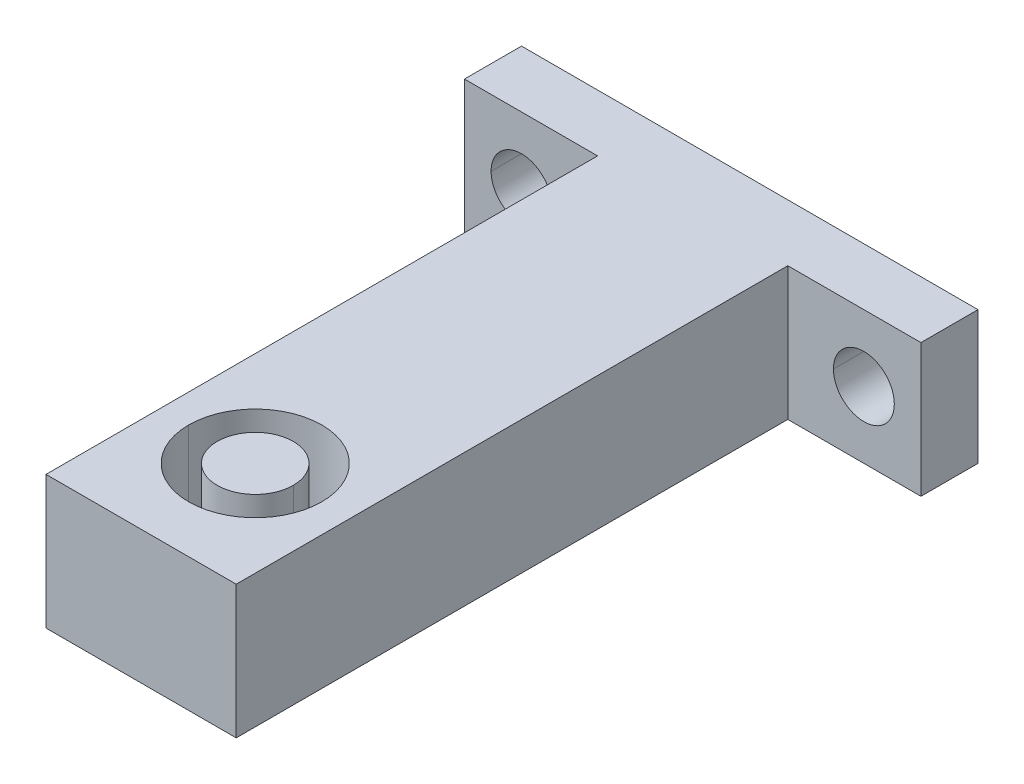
ISO-10303-21;
HEADER;
FILE_DESCRIPTION(('STEP AP214'),'2;1');
FILE_NAME('part.step','',(''),(''),'','','');
FILE_SCHEMA(('AUTOMOTIVE_DESIGN { 1 0 10303 214 1 1 1 1 }'));
ENDSEC;
DATA;
#1=APPLICATION_CONTEXT('core data for automotive mechanical design processes');
#2=APPLICATION_PROTOCOL_DEFINITION('international standard','automotive_design',2000,#1);
#3=PRODUCT_CONTEXT('',#1,'mechanical');
#4=PRODUCT('Part','Part','',(#3));
#5=PRODUCT_RELATED_PRODUCT_CATEGORY('part','',(#4));
#6=PRODUCT_DEFINITION_FORMATION('','',#4);
#7=PRODUCT_DEFINITION_CONTEXT('part definition',#1,'design');
#8=PRODUCT_DEFINITION('design','',#6,#7);
#9=PRODUCT_DEFINITION_SHAPE('','',#8);
#10=(LENGTH_UNIT() NAMED_UNIT(*) SI_UNIT(.MILLI.,.METRE.));
#11=(NAMED_UNIT(*) PLANE_ANGLE_UNIT() SI_UNIT($,.RADIAN.));
#12=(NAMED_UNIT(*) SI_UNIT($,.STERADIAN.) SOLID_ANGLE_UNIT());
#13=UNCERTAINTY_MEASURE_WITH_UNIT(LENGTH_MEASURE(1.E-05),#10,'distance_accuracy_value','');
#14=(GEOMETRIC_REPRESENTATION_CONTEXT(3) GLOBAL_UNCERTAINTY_ASSIGNED_CONTEXT((#13)) GLOBAL_UNIT_ASSIGNED_CONTEXT((#10,
#11,#12)) REPRESENTATION_CONTEXT('',''));
#15=CARTESIAN_POINT('',(0.,0.,0.));
#16=DIRECTION('',(0.,0.,1.));
#17=DIRECTION('',(1.,0.,0.));
#18=AXIS2_PLACEMENT_3D('',#15,#16,#17);
#19=CARTESIAN_POINT('',(15.875,11.1125,-63.5));
#20=DIRECTION('',(0.,1.,0.));
#21=DIRECTION('',(0.,0.,1.));
#22=AXIS2_PLACEMENT_3D('',#19,#20,#21);
#23=PLANE('',#22);
#24=CARTESIAN_POINT('',(0.,11.1125,31.75));
#25=DIRECTION('',(0.,-1.,0.));
#26=DIRECTION('',(0.,0.,-1.));
#27=AXIS2_PLACEMENT_3D('',#24,#25,#26);
#28=CIRCLE('',#27,6.35);
#29=CARTESIAN_POINT('',(6.35,11.1125,31.75));
#30=VERTEX_POINT('',#29);
#31=CARTESIAN_POINT('',(-6.35,11.1125,31.75));
#32=VERTEX_POINT('',#31);
#33=EDGE_CURVE('P0_E47',#30,#32,#28,.T.);
#34=ORIENTED_EDGE('',*,*,#33,.F.);
#35=CARTESIAN_POINT('',(0.,11.1125,31.75));
#36=DIRECTION('',(0.,-1.,0.));
#37=DIRECTION('',(0.,0.,-1.));
#38=AXIS2_PLACEMENT_3D('',#35,#36,#37);
#39=CIRCLE('',#38,6.35);
#40=EDGE_CURVE('P0_E19',#32,#30,#39,.T.);
#41=ORIENTED_EDGE('',*,*,#40,.F.);
#42=EDGE_LOOP('',(#34,#41));
#43=FACE_BOUND('',#42,.T.);
#44=ADVANCED_FACE('P0_F16',(#43),#23,.T.);
#45=CARTESIAN_POINT('',(0.,0.,31.75));
#46=DIRECTION('',(0.,-1.,0.));
#47=DIRECTION('',(0.,0.,-1.));
#48=AXIS2_PLACEMENT_3D('',#45,#46,#47);
#49=CYLINDRICAL_SURFACE('',#48,6.35);
#50=DIRECTION('',(0.,-1.,0.));
#51=VECTOR('',#50,1.);
#52=CARTESIAN_POINT('',(-6.35,0.,31.75));
#53=LINE('',#52,#51);
#54=CARTESIAN_POINT('',(-6.35,-11.1125,31.75));
#55=VERTEX_POINT('',#54);
#56=EDGE_CURVE('P0_E25',#32,#55,#53,.T.);
#57=ORIENTED_EDGE('',*,*,#56,.F.);
#58=ORIENTED_EDGE('',*,*,#40,.T.);
#59=DIRECTION('',(0.,-1.,0.));
#60=VECTOR('',#59,1.);
#61=CARTESIAN_POINT('',(6.35,0.,31.75));
#62=LINE('',#61,#60);
#63=CARTESIAN_POINT('',(6.35,-11.1125,31.75));
#64=VERTEX_POINT('',#63);
#65=EDGE_CURVE('P0_E41',#64,#30,#62,.F.);
#66=ORIENTED_EDGE('',*,*,#65,.F.);
#67=CARTESIAN_POINT('',(0.,-11.1125,31.75));
#68=DIRECTION('',(0.,-1.,0.));
#69=DIRECTION('',(0.,0.,-1.));
#70=AXIS2_PLACEMENT_3D('',#67,#68,#69);
#71=CIRCLE('',#70,6.35);
#72=EDGE_CURVE('P0_E34',#55,#64,#71,.T.);
#73=ORIENTED_EDGE('',*,*,#72,.F.);
#74=EDGE_LOOP('',(#57,#58,#66,#73));
#75=FACE_BOUND('',#74,.T.);
#76=ADVANCED_FACE('P0_F43',(#75),#49,.T.);
#77=CARTESIAN_POINT('',(15.875,-11.1125,50.8));
#78=DIRECTION('',(0.,-1.,0.));
#79=DIRECTION('',(0.,0.,-1.));
#80=AXIS2_PLACEMENT_3D('',#77,#78,#79);
#81=PLANE('',#80);
#82=ORIENTED_EDGE('',*,*,#72,.T.);
#83=CARTESIAN_POINT('',(0.,-11.1125,31.75));
#84=DIRECTION('',(0.,-1.,0.));
#85=DIRECTION('',(0.,0.,-1.));
#86=AXIS2_PLACEMENT_3D('',#83,#84,#85);
#87=CIRCLE('',#86,6.35);
#88=EDGE_CURVE('P0_E11',#55,#64,#87,.F.);
#89=ORIENTED_EDGE('',*,*,#88,.F.);
#90=EDGE_LOOP('',(#82,#89));
#91=FACE_BOUND('',#90,.T.);
#92=ADVANCED_FACE('P0_F54',(#91),#81,.T.);
#93=CARTESIAN_POINT('',(0.,0.,31.75));
#94=DIRECTION('',(0.,-1.,0.));
#95=DIRECTION('',(0.,0.,-1.));
#96=AXIS2_PLACEMENT_3D('',#93,#94,#95);
#97=CYLINDRICAL_SURFACE('',#96,6.35);
#98=ORIENTED_EDGE('',*,*,#56,.T.);
#99=ORIENTED_EDGE('',*,*,#88,.T.);
#100=ORIENTED_EDGE('',*,*,#65,.T.);
#101=ORIENTED_EDGE('',*,*,#33,.T.);
#102=EDGE_LOOP('',(#98,#99,#100,#101));
#103=FACE_BOUND('',#102,.T.);
#104=ADVANCED_FACE('P0_F50',(#103),#97,.T.);
#105=CLOSED_SHELL('',(#44,#76,#92,#104));
#106=MANIFOLD_SOLID_BREP('P0_B1',#105);
#107=CARTESIAN_POINT('',(28.575,0.,-44.45));
#108=DIRECTION('',(0.,0.,1.));
#109=DIRECTION('',(1.,0.,0.));
#110=AXIS2_PLACEMENT_3D('',#107,#108,#109);
#111=CYLINDRICAL_SURFACE('',#110,5.08);
#112=CARTESIAN_POINT('',(28.575,0.,-50.8));
#113=DIRECTION('',(0.,0.,1.));
#114=DIRECTION('',(1.,0.,0.));
#115=AXIS2_PLACEMENT_3D('',#112,#113,#114);
#116=CIRCLE('',#115,5.08);
#117=CARTESIAN_POINT('',(33.655,0.,-50.8));
#118=VERTEX_POINT('',#117);
#119=CARTESIAN_POINT('',(23.495,0.,-50.8));
#120=VERTEX_POINT('',#119);
#121=EDGE_CURVE('P1_E160',#118,#120,#116,.F.);
#122=ORIENTED_EDGE('',*,*,#121,.T.);
#123=DIRECTION('',(0.,0.,1.));
#124=VECTOR('',#123,1.);
#125=CARTESIAN_POINT('',(23.495,0.,-44.45));
#126=LINE('',#125,#124);
#127=CARTESIAN_POINT('',(23.495,0.,-41.275));
#128=VERTEX_POINT('',#127);
#129=EDGE_CURVE('P1_E144',#120,#128,#126,.T.);
#130=ORIENTED_EDGE('',*,*,#129,.T.);
#131=CARTESIAN_POINT('',(28.575,0.,-41.275));
#132=DIRECTION('',(0.,0.,1.));
#133=DIRECTION('',(1.,0.,0.));
#134=AXIS2_PLACEMENT_3D('',#131,#132,#133);
#135=CIRCLE('',#134,5.08);
#136=CARTESIAN_POINT('',(33.655,0.,-41.275));
#137=VERTEX_POINT('',#136);
#138=EDGE_CURVE('P1_E164',#137,#128,#135,.F.);
#139=ORIENTED_EDGE('',*,*,#138,.F.);
#140=DIRECTION('',(0.,0.,1.));
#141=VECTOR('',#140,1.);
#142=CARTESIAN_POINT('',(33.655,0.,-44.45));
#143=LINE('',#142,#141);
#144=EDGE_CURVE('P1_E141',#137,#118,#143,.F.);
#145=ORIENTED_EDGE('',*,*,#144,.T.);
#146=EDGE_LOOP('',(#122,#130,#139,#145));
#147=FACE_BOUND('',#146,.T.);
#148=ADVANCED_FACE('P1_F16',(#147),#111,.F.);
#149=CARTESIAN_POINT('',(28.575,0.,-44.45));
#150=DIRECTION('',(0.,0.,1.));
#151=DIRECTION('',(1.,0.,0.));
#152=AXIS2_PLACEMENT_3D('',#149,#150,#151);
#153=CYLINDRICAL_SURFACE('',#152,5.08);
#154=CARTESIAN_POINT('',(28.575,0.,-41.275));
#155=DIRECTION('',(0.,0.,1.));
#156=DIRECTION('',(1.,0.,0.));
#157=AXIS2_PLACEMENT_3D('',#154,#155,#156);
#158=CIRCLE('',#157,5.08);
#159=EDGE_CURVE('P1_E168',#128,#137,#158,.F.);
#160=ORIENTED_EDGE('',*,*,#159,.F.);
#161=ORIENTED_EDGE('',*,*,#129,.F.);
#162=CARTESIAN_POINT('',(28.575,0.,-50.8));
#163=DIRECTION('',(0.,0.,1.));
#164=DIRECTION('',(1.,0.,0.));
#165=AXIS2_PLACEMENT_3D('',#162,#163,#164);
#166=CIRCLE('',#165,5.08);
#167=EDGE_CURVE('P1_E157',#120,#118,#166,.F.);
#168=ORIENTED_EDGE('',*,*,#167,.T.);
#169=ORIENTED_EDGE('',*,*,#144,.F.);
#170=EDGE_LOOP('',(#160,#161,#168,#169));
#171=FACE_BOUND('',#170,.T.);
#172=ADVANCED_FACE('P1_F198',(#171),#153,.F.);
#173=CARTESIAN_POINT('',(-28.575,0.,-44.45));
#174=DIRECTION('',(0.,0.,1.));
#175=DIRECTION('',(1.,0.,0.));
#176=AXIS2_PLACEMENT_3D('',#173,#174,#175);
#177=CYLINDRICAL_SURFACE('',#176,5.08);
#178=CARTESIAN_POINT('',(-28.575,0.,-50.8));
#179=DIRECTION('',(0.,0.,1.));
#180=DIRECTION('',(1.,0.,0.));
#181=AXIS2_PLACEMENT_3D('',#178,#179,#180);
#182=CIRCLE('',#181,5.08);
#183=CARTESIAN_POINT('',(-23.495,0.,-50.8));
#184=VERTEX_POINT('',#183);
#185=CARTESIAN_POINT('',(-33.655,0.,-50.8));
#186=VERTEX_POINT('',#185);
#187=EDGE_CURVE('P1_E154',#184,#186,#182,.F.);
#188=ORIENTED_EDGE('',*,*,#187,.T.);
#189=DIRECTION('',(0.,0.,1.));
#190=VECTOR('',#189,1.);
#191=CARTESIAN_POINT('',(-33.655,0.,-44.45));
#192=LINE('',#191,#190);
#193=CARTESIAN_POINT('',(-33.655,0.,-41.275));
#194=VERTEX_POINT('',#193);
#195=EDGE_CURVE('P1_E139',#186,#194,#192,.T.);
#196=ORIENTED_EDGE('',*,*,#195,.T.);
#197=CARTESIAN_POINT('',(-28.575,0.,-41.275));
#198=DIRECTION('',(0.,0.,1.));
#199=DIRECTION('',(1.,0.,0.));
#200=AXIS2_PLACEMENT_3D('',#197,#198,#199);
#201=CIRCLE('',#200,5.08);
#202=CARTESIAN_POINT('',(-23.495,0.,-41.275));
#203=VERTEX_POINT('',#202);
#204=EDGE_CURVE('P1_E172',#203,#194,#201,.F.);
#205=ORIENTED_EDGE('',*,*,#204,.F.);
#206=DIRECTION('',(0.,0.,1.));
#207=VECTOR('',#206,1.);
#208=CARTESIAN_POINT('',(-23.495,0.,-44.45));
#209=LINE('',#208,#207);
#210=EDGE_CURVE('P1_E127',#203,#184,#209,.F.);
#211=ORIENTED_EDGE('',*,*,#210,.T.);
#212=EDGE_LOOP('',(#188,#196,#205,#211));
#213=FACE_BOUND('',#212,.T.);
#214=ADVANCED_FACE('P1_F183',(#213),#177,.F.);
#215=CARTESIAN_POINT('',(-28.575,0.,-44.45));
#216=DIRECTION('',(0.,0.,1.));
#217=DIRECTION('',(1.,0.,0.));
#218=AXIS2_PLACEMENT_3D('',#215,#216,#217);
#219=CYLINDRICAL_SURFACE('',#218,5.08);
#220=CARTESIAN_POINT('',(-28.575,0.,-41.275));
#221=DIRECTION('',(0.,0.,1.));
#222=DIRECTION('',(1.,0.,0.));
#223=AXIS2_PLACEMENT_3D('',#220,#221,#222);
#224=CIRCLE('',#223,5.08);
#225=EDGE_CURVE('P1_E133',#194,#203,#224,.F.);
#226=ORIENTED_EDGE('',*,*,#225,.F.);
#227=ORIENTED_EDGE('',*,*,#195,.F.);
#228=CARTESIAN_POINT('',(-28.575,0.,-50.8));
#229=DIRECTION('',(0.,0.,1.));
#230=DIRECTION('',(1.,0.,0.));
#231=AXIS2_PLACEMENT_3D('',#228,#229,#230);
#232=CIRCLE('',#231,5.08);
#233=EDGE_CURVE('P1_E151',#186,#184,#232,.F.);
#234=ORIENTED_EDGE('',*,*,#233,.T.);
#235=ORIENTED_EDGE('',*,*,#210,.F.);
#236=EDGE_LOOP('',(#226,#227,#234,#235));
#237=FACE_BOUND('',#236,.T.);
#238=ADVANCED_FACE('P1_F185',(#237),#219,.F.);
#239=CARTESIAN_POINT('',(17.4625,11.1125,-46.0375));
#240=DIRECTION('',(0.,-1.,0.));
#241=DIRECTION('',(0.,0.,-1.));
#242=AXIS2_PLACEMENT_3D('',#239,#240,#241);
#243=PLANE('',#242);
#244=DIRECTION('',(0.,0.,1.));
#245=VECTOR('',#244,1.);
#246=CARTESIAN_POINT('',(-38.1,11.1125,-50.8));
#247=LINE('',#246,#245);
#248=CARTESIAN_POINT('',(-38.1,11.1125,-41.275));
#249=VERTEX_POINT('',#248);
#250=CARTESIAN_POINT('',(-38.1,11.1125,-50.8));
#251=VERTEX_POINT('',#250);
#252=EDGE_CURVE('P1_E131',#249,#251,#247,.F.);
#253=ORIENTED_EDGE('',*,*,#252,.F.);
#254=DIRECTION('',(1.,0.,0.));
#255=VECTOR('',#254,1.);
#256=CARTESIAN_POINT('',(-17.4625,11.1125,-41.275));
#257=LINE('',#256,#255);
#258=CARTESIAN_POINT('',(-15.875,11.1125,-41.275));
#259=VERTEX_POINT('',#258);
#260=EDGE_CURVE('P1_E175',#259,#249,#257,.F.);
#261=ORIENTED_EDGE('',*,*,#260,.F.);
#262=DIRECTION('',(0.,0.,1.));
#263=VECTOR('',#262,1.);
#264=CARTESIAN_POINT('',(-15.875,11.1125,50.8));
#265=LINE('',#264,#263);
#266=CARTESIAN_POINT('',(-15.875,11.1125,50.8));
#267=VERTEX_POINT('',#266);
#268=EDGE_CURVE('P1_E269',#267,#259,#265,.F.);
#269=ORIENTED_EDGE('',*,*,#268,.F.);
#270=DIRECTION('',(1.,0.,0.));
#271=VECTOR('',#270,1.);
#272=CARTESIAN_POINT('',(15.875,11.1125,50.8));
#273=LINE('',#272,#271);
#274=CARTESIAN_POINT('',(15.875,11.1125,50.8));
#275=VERTEX_POINT('',#274);
#276=EDGE_CURVE('P1_E264',#275,#267,#273,.F.);
#277=ORIENTED_EDGE('',*,*,#276,.F.);
#278=DIRECTION('',(0.,0.,1.));
#279=VECTOR('',#278,1.);
#280=CARTESIAN_POINT('',(15.875,11.1125,-6.35));
#281=LINE('',#280,#279);
#282=CARTESIAN_POINT('',(15.875,11.1125,-41.275));
#283=VERTEX_POINT('',#282);
#284=EDGE_CURVE('P1_E171',#275,#283,#281,.F.);
#285=ORIENTED_EDGE('',*,*,#284,.T.);
#286=DIRECTION('',(1.,0.,0.));
#287=VECTOR('',#286,1.);
#288=CARTESIAN_POINT('',(17.4625,11.1125,-41.275));
#289=LINE('',#288,#287);
#290=CARTESIAN_POINT('',(38.1,11.1125,-41.275));
#291=VERTEX_POINT('',#290);
#292=EDGE_CURVE('P1_E167',#291,#283,#289,.F.);
#293=ORIENTED_EDGE('',*,*,#292,.F.);
#294=DIRECTION('',(0.,0.,-1.));
#295=VECTOR('',#294,1.);
#296=CARTESIAN_POINT('',(38.1,11.1125,-50.8));
#297=LINE('',#296,#295);
#298=CARTESIAN_POINT('',(38.1,11.1125,-50.8));
#299=VERTEX_POINT('',#298);
#300=EDGE_CURVE('P1_E163',#299,#291,#297,.F.);
#301=ORIENTED_EDGE('',*,*,#300,.F.);
#302=DIRECTION('',(1.,0.,0.));
#303=VECTOR('',#302,1.);
#304=CARTESIAN_POINT('',(17.4625,11.1125,-50.8));
#305=LINE('',#304,#303);
#306=EDGE_CURVE('P1_E250',#299,#251,#305,.F.);
#307=ORIENTED_EDGE('',*,*,#306,.T.);
#308=EDGE_LOOP('',(#253,#261,#269,#277,#285,#293,#301,#307));
#309=FACE_BOUND('',#308,.T.);
#310=CARTESIAN_POINT('',(0.,11.1125,31.75));
#311=DIRECTION('',(0.,-1.,0.));
#312=DIRECTION('',(0.,0.,-1.));
#313=AXIS2_PLACEMENT_3D('',#310,#311,#312);
#314=CIRCLE('',#313,11.1125);
#315=CARTESIAN_POINT('',(11.1125,11.1125,31.75));
#316=VERTEX_POINT('',#315);
#317=CARTESIAN_POINT('',(-11.1125,11.1125,31.75));
#318=VERTEX_POINT('',#317);
#319=EDGE_CURVE('P1_E119',#316,#318,#314,.T.);
#320=ORIENTED_EDGE('',*,*,#319,.T.);
#321=CARTESIAN_POINT('',(0.,11.1125,31.75));
#322=DIRECTION('',(0.,-1.,0.));
#323=DIRECTION('',(0.,0.,-1.));
#324=AXIS2_PLACEMENT_3D('',#321,#322,#323);
#325=CIRCLE('',#324,11.1125);
#326=EDGE_CURVE('P1_E19',#318,#316,#325,.T.);
#327=ORIENTED_EDGE('',*,*,#326,.T.);
#328=EDGE_LOOP('',(#320,#327));
#329=FACE_BOUND('',#328,.T.);
#330=ADVANCED_FACE('P1_F126',(#309,#329),#243,.F.);
#331=CARTESIAN_POINT('',(0.,0.,31.75));
#332=DIRECTION('',(0.,-1.,0.));
#333=DIRECTION('',(0.,0.,-1.));
#334=AXIS2_PLACEMENT_3D('',#331,#332,#333);
#335=CYLINDRICAL_SURFACE('',#334,11.1125);
#336=ORIENTED_EDGE('',*,*,#326,.F.);
#337=DIRECTION('',(0.,-1.,0.));
#338=VECTOR('',#337,1.);
#339=CARTESIAN_POINT('',(-11.1125,0.,31.75));
#340=LINE('',#339,#338);
#341=CARTESIAN_POINT('',(-11.1125,-11.1125,31.75));
#342=VERTEX_POINT('',#341);
#343=EDGE_CURVE('P1_E124',#318,#342,#340,.T.);
#344=ORIENTED_EDGE('',*,*,#343,.T.);
#345=CARTESIAN_POINT('',(0.,-11.1125,31.75));
#346=DIRECTION('',(0.,-1.,0.));
#347=DIRECTION('',(0.,0.,-1.));
#348=AXIS2_PLACEMENT_3D('',#345,#346,#347);
#349=CIRCLE('',#348,11.1125);
#350=CARTESIAN_POINT('',(11.1125,-11.1125,31.75));
#351=VERTEX_POINT('',#350);
#352=EDGE_CURVE('P1_E130',#342,#351,#349,.T.);
#353=ORIENTED_EDGE('',*,*,#352,.T.);
#354=DIRECTION('',(0.,-1.,0.));
#355=VECTOR('',#354,1.);
#356=CARTESIAN_POINT('',(11.1125,0.,31.75));
#357=LINE('',#356,#355);
#358=EDGE_CURVE('P1_E122',#351,#316,#357,.F.);
#359=ORIENTED_EDGE('',*,*,#358,.T.);
#360=EDGE_LOOP('',(#336,#344,#353,#359));
#361=FACE_BOUND('',#360,.T.);
#362=ADVANCED_FACE('P1_F129',(#361),#335,.F.);
#363=CARTESIAN_POINT('',(0.,0.,31.75));
#364=DIRECTION('',(0.,-1.,0.));
#365=DIRECTION('',(0.,0.,-1.));
#366=AXIS2_PLACEMENT_3D('',#363,#364,#365);
#367=CYLINDRICAL_SURFACE('',#366,11.1125);
#368=CARTESIAN_POINT('',(0.,-11.1125,31.75));
#369=DIRECTION('',(0.,-1.,0.));
#370=DIRECTION('',(0.,0.,-1.));
#371=AXIS2_PLACEMENT_3D('',#368,#369,#370);
#372=CIRCLE('',#371,11.1125);
#373=EDGE_CURVE('P1_E146',#351,#342,#372,.T.);
#374=ORIENTED_EDGE('',*,*,#373,.T.);
#375=ORIENTED_EDGE('',*,*,#343,.F.);
#376=ORIENTED_EDGE('',*,*,#319,.F.);
#377=ORIENTED_EDGE('',*,*,#358,.F.);
#378=EDGE_LOOP('',(#374,#375,#376,#377));
#379=FACE_BOUND('',#378,.T.);
#380=ADVANCED_FACE('P1_F121',(#379),#367,.F.);
#381=CARTESIAN_POINT('',(-38.1,-11.1125,-50.8));
#382=DIRECTION('',(-1.,0.,0.));
#383=DIRECTION('',(0.,0.,1.));
#384=AXIS2_PLACEMENT_3D('',#381,#382,#383);
#385=PLANE('',#384);
#386=DIRECTION('',(0.,1.,0.));
#387=VECTOR('',#386,1.);
#388=CARTESIAN_POINT('',(-38.1,0.,-50.8));
#389=LINE('',#388,#387);
#390=CARTESIAN_POINT('',(-38.1,-11.1125,-50.8));
#391=VERTEX_POINT('',#390);
#392=EDGE_CURVE('P1_E150',#251,#391,#389,.F.);
#393=ORIENTED_EDGE('',*,*,#392,.T.);
#394=DIRECTION('',(0.,0.,1.));
#395=VECTOR('',#394,1.);
#396=CARTESIAN_POINT('',(-38.1,-11.1125,-46.0375));
#397=LINE('',#396,#395);
#398=CARTESIAN_POINT('',(-38.1,-11.1125,-41.275));
#399=VERTEX_POINT('',#398);
#400=EDGE_CURVE('P1_E148',#391,#399,#397,.T.);
#401=ORIENTED_EDGE('',*,*,#400,.T.);
#402=DIRECTION('',(0.,1.,0.));
#403=VECTOR('',#402,1.);
#404=CARTESIAN_POINT('',(-38.1,0.,-41.275));
#405=LINE('',#404,#403);
#406=EDGE_CURVE('P1_E274',#249,#399,#405,.F.);
#407=ORIENTED_EDGE('',*,*,#406,.F.);
#408=ORIENTED_EDGE('',*,*,#252,.T.);
#409=EDGE_LOOP('',(#393,#401,#407,#408));
#410=FACE_BOUND('',#409,.T.);
#411=ADVANCED_FACE('P1_F284',(#410),#385,.T.);
#412=CARTESIAN_POINT('',(-17.4625,0.,-41.275));
#413=DIRECTION('',(0.,0.,1.));
#414=DIRECTION('',(1.,0.,0.));
#415=AXIS2_PLACEMENT_3D('',#412,#413,#414);
#416=PLANE('',#415);
#417=ORIENTED_EDGE('',*,*,#406,.T.);
#418=DIRECTION('',(1.,0.,0.));
#419=VECTOR('',#418,1.);
#420=CARTESIAN_POINT('',(17.4625,-11.1125,-41.275));
#421=LINE('',#420,#419);
#422=CARTESIAN_POINT('',(-15.875,-11.1125,-41.275));
#423=VERTEX_POINT('',#422);
#424=EDGE_CURVE('P1_E243',#399,#423,#421,.T.);
#425=ORIENTED_EDGE('',*,*,#424,.T.);
#426=DIRECTION('',(0.,1.,0.));
#427=VECTOR('',#426,1.);
#428=CARTESIAN_POINT('',(-15.875,-11.1125,-41.275));
#429=LINE('',#428,#427);
#430=EDGE_CURVE('P1_E272',#259,#423,#429,.F.);
#431=ORIENTED_EDGE('',*,*,#430,.F.);
#432=ORIENTED_EDGE('',*,*,#260,.T.);
#433=EDGE_LOOP('',(#417,#425,#431,#432));
#434=FACE_BOUND('',#433,.T.);
#435=ORIENTED_EDGE('',*,*,#225,.T.);
#436=ORIENTED_EDGE('',*,*,#204,.T.);
#437=EDGE_LOOP('',(#435,#436));
#438=FACE_BOUND('',#437,.T.);
#439=ADVANCED_FACE('P1_F180',(#434,#438),#416,.T.);
#440=CARTESIAN_POINT('',(-15.875,-11.1125,50.8));
#441=DIRECTION('',(-1.,0.,0.));
#442=DIRECTION('',(0.,0.,1.));
#443=AXIS2_PLACEMENT_3D('',#440,#441,#442);
#444=PLANE('',#443);
#445=DIRECTION('',(0.,1.,0.));
#446=VECTOR('',#445,1.);
#447=CARTESIAN_POINT('',(-15.875,11.1125,50.8));
#448=LINE('',#447,#446);
#449=CARTESIAN_POINT('',(-15.875,-11.1125,50.8));
#450=VERTEX_POINT('',#449);
#451=EDGE_CURVE('P1_E267',#267,#450,#448,.F.);
#452=ORIENTED_EDGE('',*,*,#451,.F.);
#453=ORIENTED_EDGE('',*,*,#268,.T.);
#454=ORIENTED_EDGE('',*,*,#430,.T.);
#455=DIRECTION('',(0.,0.,1.));
#456=VECTOR('',#455,1.);
#457=CARTESIAN_POINT('',(-15.875,-11.1125,-46.0375));
#458=LINE('',#457,#456);
#459=EDGE_CURVE('P1_E240',#423,#450,#458,.T.);
#460=ORIENTED_EDGE('',*,*,#459,.T.);
#461=EDGE_LOOP('',(#452,#453,#454,#460));
#462=FACE_BOUND('',#461,.T.);
#463=ADVANCED_FACE('P1_F289',(#462),#444,.T.);
#464=CARTESIAN_POINT('',(15.875,11.1125,50.8));
#465=DIRECTION('',(0.,0.,1.));
#466=DIRECTION('',(1.,0.,0.));
#467=AXIS2_PLACEMENT_3D('',#464,#465,#466);
#468=PLANE('',#467);
#469=DIRECTION('',(0.,1.,0.));
#470=VECTOR('',#469,1.);
#471=CARTESIAN_POINT('',(15.875,0.,50.8));
#472=LINE('',#471,#470);
#473=CARTESIAN_POINT('',(15.875,-11.1125,50.8));
#474=VERTEX_POINT('',#473);
#475=EDGE_CURVE('P1_E261',#474,#275,#472,.T.);
#476=ORIENTED_EDGE('',*,*,#475,.T.);
#477=ORIENTED_EDGE('',*,*,#276,.T.);
#478=ORIENTED_EDGE('',*,*,#451,.T.);
#479=DIRECTION('',(1.,0.,0.));
#480=VECTOR('',#479,1.);
#481=CARTESIAN_POINT('',(17.4625,-11.1125,50.8));
#482=LINE('',#481,#480);
#483=EDGE_CURVE('P1_E235',#450,#474,#482,.T.);
#484=ORIENTED_EDGE('',*,*,#483,.T.);
#485=EDGE_LOOP('',(#476,#477,#478,#484));
#486=FACE_BOUND('',#485,.T.);
#487=ADVANCED_FACE('P1_F212',(#486),#468,.T.);
#488=CARTESIAN_POINT('',(15.875,0.,-6.35));
#489=DIRECTION('',(-1.,0.,0.));
#490=DIRECTION('',(0.,0.,1.));
#491=AXIS2_PLACEMENT_3D('',#488,#489,#490);
#492=PLANE('',#491);
#493=ORIENTED_EDGE('',*,*,#284,.F.);
#494=ORIENTED_EDGE('',*,*,#475,.F.);
#495=DIRECTION('',(0.,0.,1.));
#496=VECTOR('',#495,1.);
#497=CARTESIAN_POINT('',(15.875,-11.1125,-46.0375));
#498=LINE('',#497,#496);
#499=CARTESIAN_POINT('',(15.875,-11.1125,-41.275));
#500=VERTEX_POINT('',#499);
#501=EDGE_CURVE('P1_E233',#474,#500,#498,.F.);
#502=ORIENTED_EDGE('',*,*,#501,.T.);
#503=DIRECTION('',(0.,1.,0.));
#504=VECTOR('',#503,1.);
#505=CARTESIAN_POINT('',(15.875,0.,-41.275));
#506=LINE('',#505,#504);
#507=EDGE_CURVE('P1_E232',#283,#500,#506,.F.);
#508=ORIENTED_EDGE('',*,*,#507,.F.);
#509=EDGE_LOOP('',(#493,#494,#502,#508));
#510=FACE_BOUND('',#509,.T.);
#511=ADVANCED_FACE('P1_F202',(#510),#492,.F.);
#512=CARTESIAN_POINT('',(17.4625,0.,-41.275));
#513=DIRECTION('',(0.,0.,1.));
#514=DIRECTION('',(1.,0.,0.));
#515=AXIS2_PLACEMENT_3D('',#512,#513,#514);
#516=PLANE('',#515);
#517=DIRECTION('',(1.,0.,0.));
#518=VECTOR('',#517,1.);
#519=CARTESIAN_POINT('',(17.4625,-11.1125,-41.275));
#520=LINE('',#519,#518);
#521=CARTESIAN_POINT('',(38.1,-11.1125,-41.275));
#522=VERTEX_POINT('',#521);
#523=EDGE_CURVE('P1_E226',#500,#522,#520,.T.);
#524=ORIENTED_EDGE('',*,*,#523,.T.);
#525=DIRECTION('',(0.,1.,0.));
#526=VECTOR('',#525,1.);
#527=CARTESIAN_POINT('',(38.1,-11.1125,-41.275));
#528=LINE('',#527,#526);
#529=EDGE_CURVE('P1_E230',#291,#522,#528,.F.);
#530=ORIENTED_EDGE('',*,*,#529,.F.);
#531=ORIENTED_EDGE('',*,*,#292,.T.);
#532=ORIENTED_EDGE('',*,*,#507,.T.);
#533=EDGE_LOOP('',(#524,#530,#531,#532));
#534=FACE_BOUND('',#533,.T.);
#535=ORIENTED_EDGE('',*,*,#159,.T.);
#536=ORIENTED_EDGE('',*,*,#138,.T.);
#537=EDGE_LOOP('',(#535,#536));
#538=FACE_BOUND('',#537,.T.);
#539=ADVANCED_FACE('P1_F200',(#534,#538),#516,.T.);
#540=CARTESIAN_POINT('',(38.1,-11.1125,-50.8));
#541=DIRECTION('',(1.,0.,0.));
#542=DIRECTION('',(0.,0.,-1.));
#543=AXIS2_PLACEMENT_3D('',#540,#541,#542);
#544=PLANE('',#543);
#545=DIRECTION('',(0.,1.,0.));
#546=VECTOR('',#545,1.);
#547=CARTESIAN_POINT('',(38.1,0.,-50.8));
#548=LINE('',#547,#546);
#549=CARTESIAN_POINT('',(38.1,-11.1125,-50.8));
#550=VERTEX_POINT('',#549);
#551=EDGE_CURVE('P1_E33',#550,#299,#548,.T.);
#552=ORIENTED_EDGE('',*,*,#551,.T.);
#553=ORIENTED_EDGE('',*,*,#300,.T.);
#554=ORIENTED_EDGE('',*,*,#529,.T.);
#555=DIRECTION('',(0.,0.,1.));
#556=VECTOR('',#555,1.);
#557=CARTESIAN_POINT('',(38.1,-11.1125,-46.0375));
#558=LINE('',#557,#556);
#559=EDGE_CURVE('P1_E25',#522,#550,#558,.F.);
#560=ORIENTED_EDGE('',*,*,#559,.T.);
#561=EDGE_LOOP('',(#552,#553,#554,#560));
#562=FACE_BOUND('',#561,.T.);
#563=ADVANCED_FACE('P1_F191',(#562),#544,.T.);
#564=CARTESIAN_POINT('',(17.4625,0.,-50.8));
#565=DIRECTION('',(0.,0.,1.));
#566=DIRECTION('',(1.,0.,0.));
#567=AXIS2_PLACEMENT_3D('',#564,#565,#566);
#568=PLANE('',#567);
#569=ORIENTED_EDGE('',*,*,#392,.F.);
#570=ORIENTED_EDGE('',*,*,#306,.F.);
#571=ORIENTED_EDGE('',*,*,#551,.F.);
#572=DIRECTION('',(1.,0.,0.));
#573=VECTOR('',#572,1.);
#574=CARTESIAN_POINT('',(17.4625,-11.1125,-50.8));
#575=LINE('',#574,#573);
#576=EDGE_CURVE('P1_E11',#550,#391,#575,.F.);
#577=ORIENTED_EDGE('',*,*,#576,.T.);
#578=EDGE_LOOP('',(#569,#570,#571,#577));
#579=FACE_BOUND('',#578,.T.);
#580=ORIENTED_EDGE('',*,*,#187,.F.);
#581=ORIENTED_EDGE('',*,*,#233,.F.);
#582=EDGE_LOOP('',(#580,#581));
#583=FACE_BOUND('',#582,.T.);
#584=ORIENTED_EDGE('',*,*,#121,.F.);
#585=ORIENTED_EDGE('',*,*,#167,.F.);
#586=EDGE_LOOP('',(#584,#585));
#587=FACE_BOUND('',#586,.T.);
#588=ADVANCED_FACE('P1_F187',(#579,#583,#587),#568,.F.);
#589=CARTESIAN_POINT('',(17.4625,-11.1125,-46.0375));
#590=DIRECTION('',(0.,1.,0.));
#591=DIRECTION('',(0.,0.,1.));
#592=AXIS2_PLACEMENT_3D('',#589,#590,#591);
#593=PLANE('',#592);
#594=ORIENTED_EDGE('',*,*,#559,.F.);
#595=ORIENTED_EDGE('',*,*,#523,.F.);
#596=ORIENTED_EDGE('',*,*,#501,.F.);
#597=ORIENTED_EDGE('',*,*,#483,.F.);
#598=ORIENTED_EDGE('',*,*,#459,.F.);
#599=ORIENTED_EDGE('',*,*,#424,.F.);
#600=ORIENTED_EDGE('',*,*,#400,.F.);
#601=ORIENTED_EDGE('',*,*,#576,.F.);
#602=EDGE_LOOP('',(#594,#595,#596,#597,#598,#599,#600,#601));
#603=FACE_BOUND('',#602,.T.);
#604=ORIENTED_EDGE('',*,*,#352,.F.);
#605=ORIENTED_EDGE('',*,*,#373,.F.);
#606=EDGE_LOOP('',(#604,#605));
#607=FACE_BOUND('',#606,.T.);
#608=ADVANCED_FACE('P1_F190',(#603,#607),#593,.F.);
#609=CLOSED_SHELL('',(#148,#172,#214,#238,#330,#362,#380,#411,#439,#463,#487,#511,#539,#563,
#588,#608));
#610=MANIFOLD_SOLID_BREP('P1_B1',#609);
#611=ADVANCED_BREP_SHAPE_REPRESENTATION('',(#18,#106,#610),#14);
#612=SHAPE_DEFINITION_REPRESENTATION(#9,#611);
ENDSEC;
END-ISO-10303-21;
